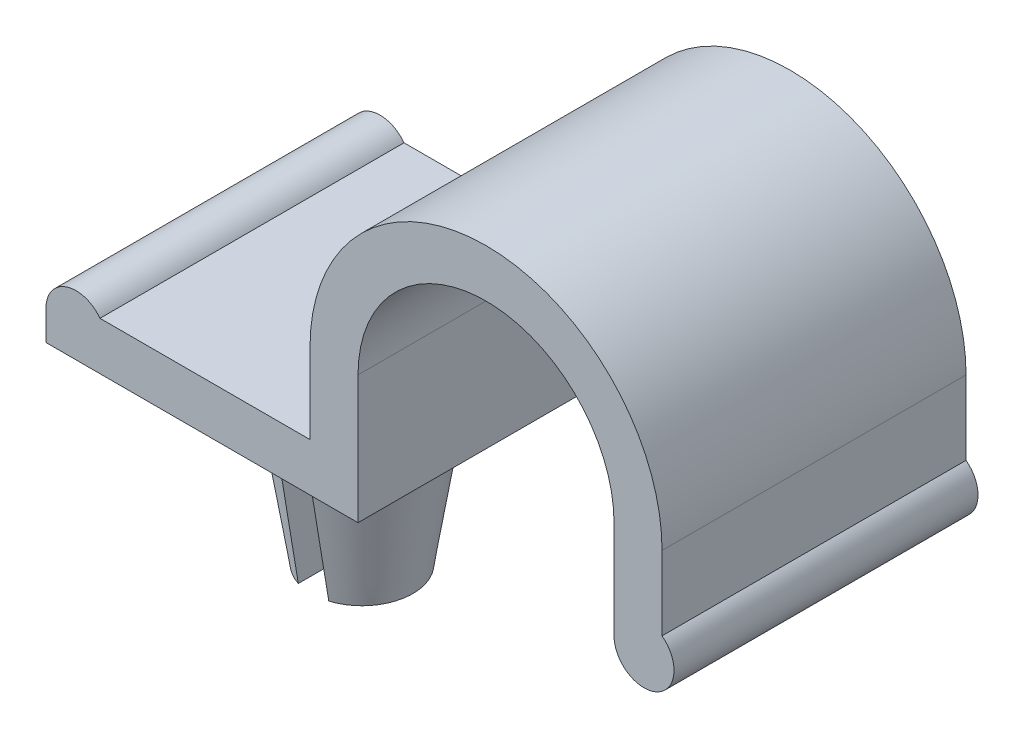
from build123d import *

# Parameters (mm, degrees)
BASE_EXTRUDE_DEPTH      = 3.8
CUT_EXTRUDE1_DEPTH      = 15.038454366
CUT_EXTRUDE1_DEPTH_BACK = 15.038454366


with BuildPart() as part:
    # Sketch1 → Base-Extrude (new, symmetric)
    with BuildSketch(Plane.XY):
        with BuildLine():
            Line((-9.65, -2), (-4.4, -2))
            Line((-4.4, -2), (-4.4, 0))
            ThreePointArc((-4.4, 0), (0, 4.4), (4.4, 0))
            Line((4.4, 0), (4.4, -1.85))
            ThreePointArc((4.4, -1.85), (4.285410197, -3.120820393), (3.2, -2.45))
            Line((3.2, -2.45), (3.2, 0))
            ThreePointArc((3.2, 0), (0, 3.2), (-3.2, 0))
            Line((-3.2, 0), (-3.2, -3.2))
            Line((-3.2, -3.2), (-11, -3.2))
            Line((-11, -3.2), (-11, -2.45))
            ThreePointArc((-11, -2.45), (-10.487170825, -1.738487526), (-9.65, -2))
        make_face()
    extrude(amount=BASE_EXTRUDE_DEPTH, both=True)

    # Sketch4 → Boss-Revolve1 (revolve)
    with BuildSketch(Plane.XY, mode=Mode.PRIVATE) as boss_revolve1_sk:
        Polygon((-6.9, -3.2), (-6.9, -7.851), (-5.63, -7.851), (-5.15, -4.851), (-5.4, -4.851), (-5.4, -3.2), align=None)
    revolve(boss_revolve1_sk.sketch.rotate(Axis((-6.9, -3.2, 0), (0, 1, 0)), 90), axis=Axis((-6.9, -3.2, 0), (0, 1, 0)))

    # Sketch5 → Cut-Extrude1 (cut, two sides: drawn at the far end of the back side and taken through both)
    with BuildSketch(Plane.XY.offset(-CUT_EXTRUDE1_DEPTH_BACK)):
        with BuildLine():
            Line((-7.281, -7.851), (-6.519, -7.851))
            Line((-6.519, -7.851), (-6.519, -3.787))
            ThreePointArc((-6.519, -3.787), (-6.9, -3.406), (-7.281, -3.787))
            Line((-7.281, -3.787), (-7.281, -7.851))
        make_face()
    extrude(amount=CUT_EXTRUDE1_DEPTH + CUT_EXTRUDE1_DEPTH_BACK, mode=Mode.SUBTRACT)


solid = part.part
